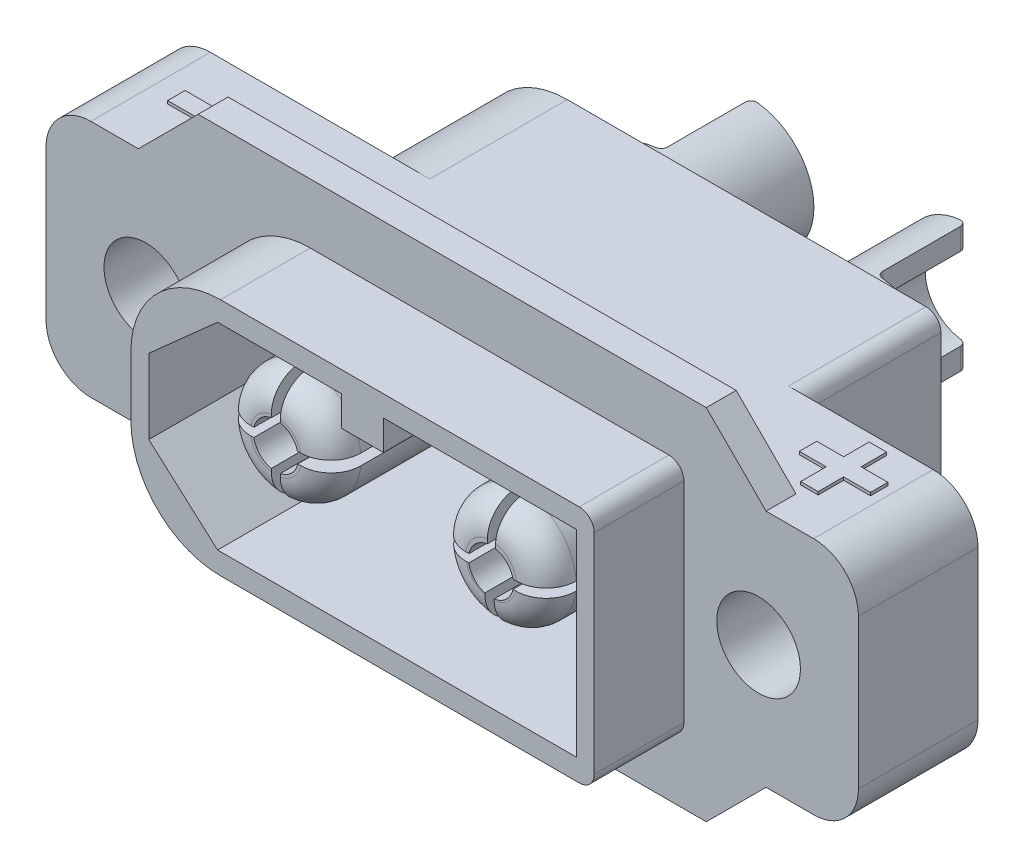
from build123d import *

# Parameters (mm, degrees)
BOSS_EXTRUDE1_DEPTH       = 3
BOSS_EXTRUDE1_DEPTH_BACK  = 8.6
SKETCH1_W                 = 15.5
SKETCH1_H                 = 8
FILLET1_R                 = 3
FILLET2_R                 = 0.5
SKETCH2_W                 = 27.18
SKETCH2_H                 = 8
BOSS_EXTRUDE2_DEPTH       = 4
FILLET3_R                 = 1.5
CUT_EXTRUDE1_DEPTH        = 1
BOSS_EXTRUDE3_DEPTH       = 1
SKETCH5_R                 = 1.4
CUT_EXTRUDE2_DEPTH        = 18.165316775
CUT_EXTRUDE3_DEPTH        = 2
CUT_EXTRUDE4_DEPTH        = 8.8
SKETCH8_R                 = 2.1
BOSS_EXTRUDE4_DEPTH       = 6
F_2_5MM_DOWEL_HOLE1_D     = 2.75
F_2_5MM_DOWEL_HOLE1_DEPTH = 6
F_2_5MM_DOWEL_HOLE1_TIP   = 0.826183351
SKETCH11_W                = 3.440433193
SKETCH11_H                = 4.792031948
SKETCH11_W_2              = 3.391284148
SKETCH11_H_2              = 4.542096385
CUT_EXTRUDE5_DEPTH        = 4.4
FILLET4_R                 = 0.2
SKETCH12_R                = 1.85
BOSS_EXTRUDE5_DEPTH       = 8.1
FILLET5_R                 = 1
CUT_EXTRUDE6_REACH        = 23.76
SKETCH15_W                = 1.211538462
SKETCH15_H                = 0.583333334
BOSS_EXTRUDE6_DEPTH       = 0.1


with BuildPart() as part:
    # Sketch1 → Boss-Extrude1 (new, two sides: drawn at the far end of the back side and taken through both)
    with BuildSketch(Plane.XY.offset(-BOSS_EXTRUDE1_DEPTH_BACK)):
        Rectangle(SKETCH1_W, SKETCH1_H)
    extrude(amount=BOSS_EXTRUDE1_DEPTH + BOSS_EXTRUDE1_DEPTH_BACK)

    # Fillet1
    fillet1_edges = [part.edges().sort_by_distance(p)[0] for p in [
        (-7.75, 4, -2.8),
        (-7.75, -4, -2.8),
    ]]
    fillet(fillet1_edges, radius=FILLET1_R)

    # Fillet2
    fillet2_edges = [part.edges().sort_by_distance(p)[0] for p in [
        (7.75, 4, -2.8),
        (7.75, -4, -2.8),
    ]]
    fillet(fillet2_edges, radius=FILLET2_R)

    # Sketch2 → Boss-Extrude2 (add)
    with BuildSketch(Plane.XY):
        Rectangle(SKETCH2_W, SKETCH2_H)
    extrude(amount=-BOSS_EXTRUDE2_DEPTH)

    # Fillet3
    fillet3_edges = [part.edges().sort_by_distance(p)[0] for p in [
        (13.59, -4, -2),
        (-13.59, 4, -2),
        (-13.59, -4, -2),
        (13.59, 4, -2),
    ]]
    fillet(fillet3_edges, radius=FILLET3_R)

    # Sketch3 → Cut-Extrude1 (cut)
    with BuildSketch(Plane(origin=(0, 0, -8.6), x_dir=(-1, 0, 0), z_dir=(0, 0, -1))):
        with BuildLine():
            Line((-7.05, 3.3), (-7.05, -3.3))
            Line((-7.05, -3.3), (4.75, -3.3))
            ThreePointArc((4.75, -3.3), (6.376345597, -2.626345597), (7.05, -1))
            Line((7.05, -1), (7.05, 1))
            ThreePointArc((7.05, 1), (6.376345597, 2.626345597), (4.75, 3.3))
            Line((4.75, 3.3), (-7.05, 3.3))
        make_face()
    extrude(amount=-CUT_EXTRUDE1_DEPTH, mode=Mode.SUBTRACT)

    # Sketch4 → Boss-Extrude3 (add)
    with BuildSketch(Plane.XY):
        Polygon((8.5, 6), (10.5, 4), (10.5, -4), (8.5, -6), (-8.5, -6), (-10.5, -4), (-10.5, 4), (-8.5, 6), align=None)
    extrude(amount=-BOSS_EXTRUDE3_DEPTH)

    # Sketch5 → Cut-Extrude2 (cut, through all)
    with BuildSketch(Plane.XY):
        with Locations((10.25, 0)):
            Circle(SKETCH5_R)
        with Locations((-10.25, 0)):
            Circle(SKETCH5_R)
    extrude(amount=-CUT_EXTRUDE2_DEPTH, mode=Mode.SUBTRACT)

    # Sketch6 → Cut-Extrude3 (cut)
    with BuildSketch(Plane(origin=(0, 0, -4), x_dir=(-1, 0, 0), z_dir=(0, 0, -1))):
        Polygon((-10.25, 2.817469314), (-12.69, 1.408734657), (-12.69, -1.408734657), (-10.25, -2.817469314), (-7.81, -1.408734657), (-7.81, 1.408734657), align=None)
        Polygon((10.25, 2.817469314), (7.81, 1.408734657), (7.81, -1.408734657), (10.25, -2.817469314), (12.69, -1.408734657), (12.69, 1.408734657), align=None)
    extrude(amount=-CUT_EXTRUDE3_DEPTH, mode=Mode.SUBTRACT)

    # Sketch7 → Cut-Extrude4 (cut)
    with BuildSketch(Plane.XY.offset(3)):
        Polygon((7.15, 3.3), (7.15, -3.3), (-4.85, -3.3), (-7.15, -1.25), (-7.15, 1.25), (-4.85, 3.3), (-0.7, 3.3), (-0.7, 2.3), (0.7, 2.3), (0.7, 3.3), align=None)
    extrude(amount=-CUT_EXTRUDE4_DEPTH, mode=Mode.SUBTRACT)

    # Sketch8 → Boss-Extrude4 (add)
    with BuildSketch(Plane(origin=(0, 0, -7.6), x_dir=(-1, 0, 0), z_dir=(0, 0, -1))):
        with Locations((-3.6, 0)):
            Circle(SKETCH8_R)
        with Locations((3.6, 0)):
            Circle(SKETCH8_R)
    extrude(amount=BOSS_EXTRUDE4_DEPTH)

    # 2.5mm Dowel Hole1
    with Locations(Plane(origin=(0, 0, -13.6), x_dir=(-1, 0, 0), z_dir=(0, 0, -1))):
        with Locations((-3.6, 0), (3.6, 0)):
            Hole(F_2_5MM_DOWEL_HOLE1_D / 2, depth=F_2_5MM_DOWEL_HOLE1_DEPTH)
            with Locations((0, 0, -(F_2_5MM_DOWEL_HOLE1_DEPTH + F_2_5MM_DOWEL_HOLE1_TIP / 2))):  # 118° drill point
                Cone(0, F_2_5MM_DOWEL_HOLE1_D / 2, F_2_5MM_DOWEL_HOLE1_TIP, mode=Mode.SUBTRACT)

    # Sketch11 → Cut-Extrude5 (cut, symmetric)
    with BuildSketch(Plane(origin=(0, 0, 0), x_dir=(1, 0, 0), z_dir=(0, 1, 0))):
        with Locations((-5.320216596, 12.996015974)):
            Rectangle(SKETCH11_W, SKETCH11_H)
        with Locations((5.295642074, 12.871048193)):
            Rectangle(SKETCH11_W_2, SKETCH11_H_2)
    extrude(amount=CUT_EXTRUDE5_DEPTH, both=True, mode=Mode.SUBTRACT)

    # Fillet4
    fillet4_edges = [part.edges().sort_by_distance(p)[0] for p in [
        (-3.6, 1.7375, -10.6),
        (-3.6, -1.7375, -10.6),
        (-3.6, 1.7375, -13.6),
        (-3.6, -1.7375, -13.6),
        (3.6, 1.7375, -10.6),
        (3.6, -1.7375, -10.6),
        (3.6, -1.7375, -13.6),
        (3.6, 1.7375, -13.6),
    ]]
    fillet(fillet4_edges, radius=FILLET4_R)

    # Sketch12 → Boss-Extrude5 (add)
    with BuildSketch(Plane.XY.offset(-5.8)):
        with Locations(Location((-3.6, 0, 0), (0, 0, 180))):
            Circle(SKETCH12_R)
        with Locations(Location((3.6, 0, 0), (0, 0, 180))):
            Circle(SKETCH12_R)
    extrude(amount=BOSS_EXTRUDE5_DEPTH)

    # Fillet5
    fillet5_edges = [part.edges().sort_by_distance(p)[0] for p in [
        (-1.75, 0, 2.3),
        (5.45, 0, 2.3),
    ]]
    fillet(fillet5_edges, radius=FILLET5_R)

    # Cut-Extrude6: up to this face of the body (flat: up to its plane)
    cut_extrude6_end = Plane(part.part.faces().sort_by_distance((0.450824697, -0.058717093, -5.8))[0])
    # Sketch14 → Cut-Extrude6 (cut, up to the picked face)
    with BuildSketch(Plane.XY.offset(2.3), mode=Mode.PRIVATE) as cut_extrude6_sk1:
        with BuildLine():
            Line((-3.75, 0.734846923), (-3.75, 2.518888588))
            Line((-3.75, 2.518888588), (-3.45, 2.518888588))
            Line((-3.45, 2.518888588), (-3.45, 0.734846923))
            ThreePointArc((-3.45, 0.734846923), (-3.088291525, 0.548319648), (-2.877253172, 0.200342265))
            Line((-2.877253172, 0.200342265), (-0.812059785, 0.200342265))
            Line((-0.812059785, 0.200342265), (-0.812059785, -0.16487495))
            Line((-0.812059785, -0.16487495), (-2.868346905, -0.16487495))
            ThreePointArc((-2.868346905, -0.16487495), (-3.075076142, -0.535681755), (-3.45, -0.734846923))
            Line((-3.45, -0.734846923), (-3.45, -2.518888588))
            Line((-3.45, -2.518888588), (-3.75, -2.518888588))
            Line((-3.75, -2.518888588), (-3.75, -0.734846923))
            ThreePointArc((-3.75, -0.734846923), (-4.135554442, -0.52505375), (-4.337672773, -0.135421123))
            Line((-4.337672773, -0.135421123), (-5.890094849, -0.16456694))
            Line((-5.890094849, -0.16456694), (-5.890094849, 0.13543306))
            Line((-5.890094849, 0.13543306), (-4.331732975, 0.164520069))
            ThreePointArc((-4.331732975, 0.164520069), (-4.12505375, 0.535554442), (-3.75, 0.734846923))
        make_face()
    cut_extrude6_tool1 = split(extrude(cut_extrude6_sk1.sketch, amount=-CUT_EXTRUDE6_REACH, mode=Mode.PRIVATE), bisect_by=cut_extrude6_end, keep=Keep.BOTH, mode=Mode.PRIVATE)
    # Sketch14 → Cut-Extrude6 (cut, up to the picked face)
    with BuildSketch(Plane.XY.offset(2.3), mode=Mode.PRIVATE) as cut_extrude6_sk2:
        with BuildLine():
            Line((3.392079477, -2.61864316), (3.703960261, -2.61864316))
            Line((3.703960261, -2.61864316), (3.703960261, -0.792072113))
            ThreePointArc((3.703960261, -0.792072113), (4.111188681, -0.594965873), (4.33096163, -0.199509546))
            Line((4.33096163, -0.199509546), (6.020422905, -0.199509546))
            Line((6.020422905, -0.199509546), (6.020422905, 0.1))
            Line((6.020422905, 0.1), (4.3309117, 0.1))
            ThreePointArc((4.3309117, 0.1), (4.126414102, 0.480408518), (3.746039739, 0.684969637))
            Line((3.746039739, 0.684969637), (3.8, 2.518888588))
            Line((3.8, 2.518888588), (3.5, 2.518888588))
            Line((3.5, 2.518888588), (3.475216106, 0.690326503))
            ThreePointArc((3.475216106, 0.690326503), (3.076256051, 0.490793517), (2.861167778, 0.1))
            Line((2.861167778, 0.1), (1.179577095, 0.1))
            Line((1.179577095, 0.1), (1.179577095, -0.2))
            Line((1.179577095, -0.2), (2.855835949, -0.170700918))
            ThreePointArc((2.855835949, -0.170700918), (3.036455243, -0.549242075), (3.392079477, -0.771611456))
            Line((3.392079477, -0.771611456), (3.392079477, -2.61864316))
        make_face()
    cut_extrude6_tool2 = split(extrude(cut_extrude6_sk2.sketch, amount=-CUT_EXTRUDE6_REACH, mode=Mode.PRIVATE), bisect_by=cut_extrude6_end, keep=Keep.BOTH, mode=Mode.PRIVATE)
    add(cut_extrude6_tool1.solids().sort_by(Axis((-3.447746, 0.003301, 2.3), (0, 0, -1)))[0], mode=Mode.SUBTRACT)
    add(cut_extrude6_tool2.solids().sort_by(Axis((3.603073, -0.067799, 2.3), (0, 0, -1)))[0], mode=Mode.SUBTRACT)

    # Sketch15 → Boss-Extrude6 (add)
    with BuildSketch(Plane(origin=(0, 4, 0), x_dir=(1, 0, 0), z_dir=(0, 1, 0))):
        with Locations((-10.701923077, 2.078846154)):
            Rectangle(SKETCH15_W, SKETCH15_H)
        Polygon((10.320512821, 2.774358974), (10.320512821, 3.626923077), (10.903846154, 3.626923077), (10.903846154, 2.774358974), (11.801282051, 2.774358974), (11.801282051, 2.191025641), (10.903846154, 2.191025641), (10.903846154, 1.338461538), (10.320512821, 1.338461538), (10.320512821, 2.191025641), (9.423076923, 2.191025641), (9.423076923, 2.774358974), align=None)
    extrude(amount=BOSS_EXTRUDE6_DEPTH)


solid = part.part
